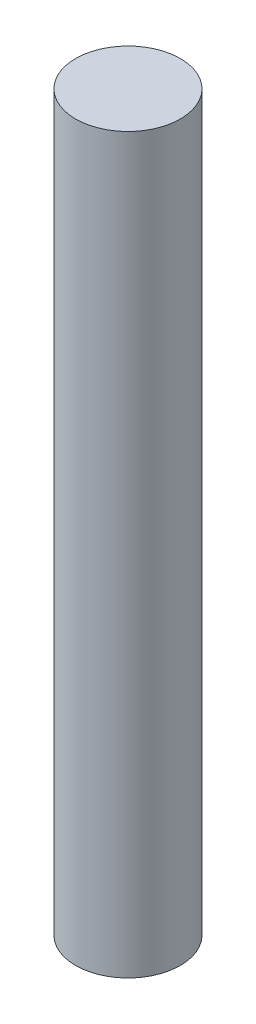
from build123d import *

# Parameters (mm, degrees)
ESQUISSE1_R      = 0.25
EXTRUSION2_DEPTH = 3.5


with BuildPart() as part:
    # Esquisse1 → Extrusion2 (new body)
    with BuildSketch(Plane(origin=(0, 0, 0), x_dir=(1, 0, 0), z_dir=(0, 1, 0))):
        with Locations(Location((0, 0, 0), (0, 0, 270))):
            Circle(ESQUISSE1_R)
    extrude(amount=EXTRUSION2_DEPTH)


solid = part.part
